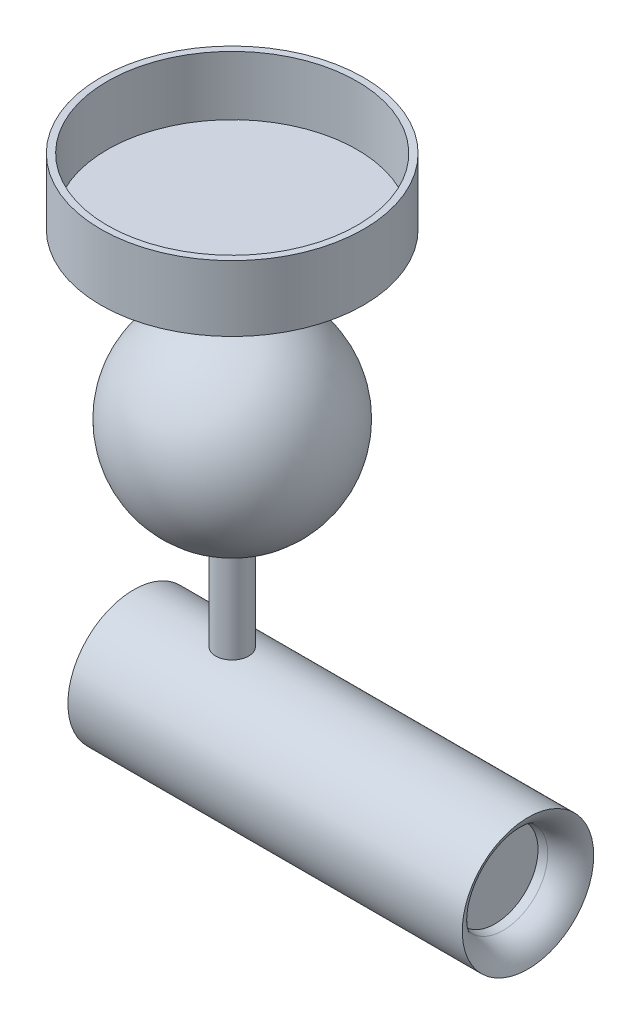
ISO-10303-21;
HEADER;
FILE_DESCRIPTION(('STEP AP214'),'2;1');
FILE_NAME('part.step','',(''),(''),'','','');
FILE_SCHEMA(('AUTOMOTIVE_DESIGN { 1 0 10303 214 1 1 1 1 }'));
ENDSEC;
DATA;
#1=APPLICATION_CONTEXT('core data for automotive mechanical design processes');
#2=APPLICATION_PROTOCOL_DEFINITION('international standard','automotive_design',2000,#1);
#3=PRODUCT_CONTEXT('',#1,'mechanical');
#4=PRODUCT('Part','Part','',(#3));
#5=PRODUCT_RELATED_PRODUCT_CATEGORY('part','',(#4));
#6=PRODUCT_DEFINITION_FORMATION('','',#4);
#7=PRODUCT_DEFINITION_CONTEXT('part definition',#1,'design');
#8=PRODUCT_DEFINITION('design','',#6,#7);
#9=PRODUCT_DEFINITION_SHAPE('','',#8);
#10=(LENGTH_UNIT() NAMED_UNIT(*) SI_UNIT(.MILLI.,.METRE.));
#11=(NAMED_UNIT(*) PLANE_ANGLE_UNIT() SI_UNIT($,.RADIAN.));
#12=(NAMED_UNIT(*) SI_UNIT($,.STERADIAN.) SOLID_ANGLE_UNIT());
#13=UNCERTAINTY_MEASURE_WITH_UNIT(LENGTH_MEASURE(1.E-05),#10,'distance_accuracy_value','');
#14=(GEOMETRIC_REPRESENTATION_CONTEXT(3) GLOBAL_UNCERTAINTY_ASSIGNED_CONTEXT((#13)) GLOBAL_UNIT_ASSIGNED_CONTEXT((#10,
#11,#12)) REPRESENTATION_CONTEXT('',''));
#15=CARTESIAN_POINT('',(0.,0.,0.));
#16=DIRECTION('',(0.,0.,1.));
#17=DIRECTION('',(1.,0.,0.));
#18=AXIS2_PLACEMENT_3D('',#15,#16,#17);
#19=CARTESIAN_POINT('',(-30.,-130.,0.));
#20=DIRECTION('',(1.,0.,0.));
#21=DIRECTION('',(0.,0.,-1.));
#22=AXIS2_PLACEMENT_3D('',#19,#20,#21);
#23=CYLINDRICAL_SURFACE('',#22,20.);
#24=CARTESIAN_POINT('',(-30.,-130.,0.));
#25=DIRECTION('',(1.,0.,0.));
#26=DIRECTION('',(0.,0.,-1.));
#27=AXIS2_PLACEMENT_3D('',#24,#25,#26);
#28=CIRCLE('',#27,20.);
#29=CARTESIAN_POINT('',(-30.,-130.,-20.));
#30=VERTEX_POINT('',#29);
#31=EDGE_CURVE('E64',#30,#30,#28,.T.);
#32=ORIENTED_EDGE('',*,*,#31,.T.);
#33=EDGE_LOOP('',(#32));
#34=FACE_BOUND('',#33,.T.);
#35=CARTESIAN_POINT('',(90.,-130.,0.));
#36=DIRECTION('',(1.,0.,0.));
#37=DIRECTION('',(0.,0.,-1.));
#38=AXIS2_PLACEMENT_3D('',#35,#36,#37);
#39=CIRCLE('',#38,20.);
#40=CARTESIAN_POINT('',(90.,-130.,-20.));
#41=VERTEX_POINT('',#40);
#42=EDGE_CURVE('E69',#41,#41,#39,.T.);
#43=ORIENTED_EDGE('',*,*,#42,.F.);
#44=EDGE_LOOP('',(#43));
#45=FACE_BOUND('',#44,.T.);
#46=ADVANCED_FACE('F56',(#34,#45),#23,.T.);
#47=CARTESIAN_POINT('',(-30.,-130.,0.));
#48=DIRECTION('',(1.,0.,0.));
#49=DIRECTION('',(0.,0.,-1.));
#50=AXIS2_PLACEMENT_3D('',#47,#48,#49);
#51=PLANE('',#50);
#52=ORIENTED_EDGE('',*,*,#31,.F.);
#53=EDGE_LOOP('',(#52));
#54=FACE_BOUND('',#53,.T.);
#55=ADVANCED_FACE('F85',(#54),#51,.F.);
#56=CARTESIAN_POINT('',(90.,-130.,0.));
#57=DIRECTION('',(1.,0.,0.));
#58=DIRECTION('',(0.,0.,-1.));
#59=AXIS2_PLACEMENT_3D('',#56,#57,#58);
#60=CONICAL_SURFACE('',#59,15.,0.191986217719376);
#61=CARTESIAN_POINT('',(82.4880806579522,-130.,0.));
#62=DIRECTION('',(-1.,0.,0.));
#63=DIRECTION('',(0.,0.,1.));
#64=AXIS2_PLACEMENT_3D('',#61,#62,#63);
#65=CIRCLE('',#64,13.5398307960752);
#66=CARTESIAN_POINT('',(82.4880806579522,-130.,13.5398307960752));
#67=VERTEX_POINT('',#66);
#68=EDGE_CURVE('E12',#67,#67,#65,.F.);
#69=ORIENTED_EDGE('',*,*,#68,.T.);
#70=EDGE_LOOP('',(#69));
#71=FACE_BOUND('',#70,.T.);
#72=CARTESIAN_POINT('',(80.,-130.,0.));
#73=DIRECTION('',(1.,0.,0.));
#74=DIRECTION('',(0.,0.,-1.));
#75=AXIS2_PLACEMENT_3D('',#72,#73,#74);
#76=CIRCLE('',#75,13.0561969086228);
#77=CARTESIAN_POINT('',(80.,-130.,-13.0561969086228));
#78=VERTEX_POINT('',#77);
#79=EDGE_CURVE('E74',#78,#78,#76,.T.);
#80=ORIENTED_EDGE('',*,*,#79,.F.);
#81=EDGE_LOOP('',(#80));
#82=FACE_BOUND('',#81,.T.);
#83=ADVANCED_FACE('F83',(#71,#82),#60,.F.);
#84=CARTESIAN_POINT('',(80.,-130.,0.));
#85=DIRECTION('',(1.,0.,0.));
#86=DIRECTION('',(0.,0.,-1.));
#87=AXIS2_PLACEMENT_3D('',#84,#85,#86);
#88=PLANE('',#87);
#89=ORIENTED_EDGE('',*,*,#79,.T.);
#90=EDGE_LOOP('',(#89));
#91=FACE_BOUND('',#90,.T.);
#92=ADVANCED_FACE('F81',(#91),#88,.T.);
#93=CARTESIAN_POINT('',(80.5799907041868,-130.,0.));
#94=DIRECTION('',(1.,0.,0.));
#95=DIRECTION('',(0.,0.,-1.));
#96=AXIS2_PLACEMENT_3D('',#93,#94,#95);
#97=TOROIDAL_SURFACE('',#96,23.3561026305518,10.);
#98=ORIENTED_EDGE('',*,*,#42,.T.);
#99=EDGE_LOOP('',(#98));
#100=FACE_BOUND('',#99,.T.);
#101=ORIENTED_EDGE('',*,*,#68,.F.);
#102=EDGE_LOOP('',(#101));
#103=FACE_BOUND('',#102,.T.);
#104=ADVANCED_FACE('F58',(#100,#103),#97,.T.);
#105=CLOSED_SHELL('',(#46,#55,#83,#92,#104));
#106=MANIFOLD_SOLID_BREP('B2',#105);
#107=CARTESIAN_POINT('',(0.,-80.,0.));
#108=DIRECTION('',(0.,-1.,0.));
#109=DIRECTION('',(1.,0.,0.));
#110=AXIS2_PLACEMENT_3D('',#107,#108,#109);
#111=PLANE('',#110);
#112=CARTESIAN_POINT('',(0.,-80.,0.));
#113=DIRECTION('',(0.,-1.,0.));
#114=DIRECTION('',(1.,0.,0.));
#115=AXIS2_PLACEMENT_3D('',#112,#113,#114);
#116=CIRCLE('',#115,5.);
#117=CARTESIAN_POINT('',(5.,-80.,0.));
#118=VERTEX_POINT('',#117);
#119=EDGE_CURVE('E153',#118,#118,#116,.T.);
#120=ORIENTED_EDGE('',*,*,#119,.F.);
#121=EDGE_LOOP('',(#120));
#122=FACE_BOUND('',#121,.T.);
#123=ADVANCED_FACE('F147',(#122),#111,.F.);
#124=CARTESIAN_POINT('',(0.,-110.,0.));
#125=DIRECTION('',(0.,-1.,0.));
#126=DIRECTION('',(1.,0.,0.));
#127=AXIS2_PLACEMENT_3D('',#124,#125,#126);
#128=PLANE('',#127);
#129=CARTESIAN_POINT('',(0.,-110.,0.));
#130=DIRECTION('',(0.,-1.,0.));
#131=DIRECTION('',(1.,0.,0.));
#132=AXIS2_PLACEMENT_3D('',#129,#130,#131);
#133=CIRCLE('',#132,5.);
#134=CARTESIAN_POINT('',(5.,-110.,0.));
#135=VERTEX_POINT('',#134);
#136=EDGE_CURVE('E55',#135,#135,#133,.T.);
#137=ORIENTED_EDGE('',*,*,#136,.T.);
#138=EDGE_LOOP('',(#137));
#139=FACE_BOUND('',#138,.T.);
#140=ADVANCED_FACE('F162',(#139),#128,.T.);
#141=CARTESIAN_POINT('',(0.,-80.,0.));
#142=DIRECTION('',(0.,-1.,0.));
#143=DIRECTION('',(1.,0.,0.));
#144=AXIS2_PLACEMENT_3D('',#141,#142,#143);
#145=CYLINDRICAL_SURFACE('',#144,5.);
#146=ORIENTED_EDGE('',*,*,#136,.F.);
#147=EDGE_LOOP('',(#146));
#148=FACE_BOUND('',#147,.T.);
#149=ORIENTED_EDGE('',*,*,#119,.T.);
#150=EDGE_LOOP('',(#149));
#151=FACE_BOUND('',#150,.T.);
#152=ADVANCED_FACE('F159',(#148,#151),#145,.T.);
#153=CLOSED_SHELL('',(#123,#140,#152));
#154=MANIFOLD_SOLID_BREP('B7',#153);
#155=CARTESIAN_POINT('',(0.,-50.,0.));
#156=DIRECTION('',(0.,1.,0.));
#157=DIRECTION('',(1.,0.,0.));
#158=AXIS2_PLACEMENT_3D('',#155,#156,#157);
#159=SPHERICAL_SURFACE('',#158,30.);
#160=CARTESIAN_POINT('',(0.,-20.,0.));
#161=VERTEX_POINT('',#160);
#162=VERTEX_LOOP('',#161);
#163=FACE_BOUND('',#162,.T.);
#164=ADVANCED_FACE('F201',(#163),#159,.T.);
#165=CLOSED_SHELL('',(#164));
#166=MANIFOLD_SOLID_BREP('B50',#165);
#167=CARTESIAN_POINT('',(0.,20.,0.));
#168=DIRECTION('',(0.,-1.,0.));
#169=DIRECTION('',(0.,0.,-1.));
#170=AXIS2_PLACEMENT_3D('',#167,#168,#169);
#171=CYLINDRICAL_SURFACE('',#170,40.);
#172=CARTESIAN_POINT('',(0.,20.,0.));
#173=DIRECTION('',(0.,1.,0.));
#174=DIRECTION('',(0.,0.,1.));
#175=AXIS2_PLACEMENT_3D('',#172,#173,#174);
#176=CIRCLE('',#175,40.);
#177=CARTESIAN_POINT('',(0.,20.,40.));
#178=VERTEX_POINT('',#177);
#179=EDGE_CURVE('E222',#178,#178,#176,.T.);
#180=ORIENTED_EDGE('',*,*,#179,.F.);
#181=EDGE_LOOP('',(#180));
#182=FACE_BOUND('',#181,.T.);
#183=CARTESIAN_POINT('',(0.,0.,0.));
#184=DIRECTION('',(0.,1.,0.));
#185=DIRECTION('',(0.,0.,1.));
#186=AXIS2_PLACEMENT_3D('',#183,#184,#185);
#187=CIRCLE('',#186,40.);
#188=CARTESIAN_POINT('',(0.,0.,40.));
#189=VERTEX_POINT('',#188);
#190=EDGE_CURVE('E226',#189,#189,#187,.T.);
#191=ORIENTED_EDGE('',*,*,#190,.T.);
#192=EDGE_LOOP('',(#191));
#193=FACE_BOUND('',#192,.T.);
#194=ADVANCED_FACE('F216',(#182,#193),#171,.T.);
#195=CARTESIAN_POINT('',(0.,20.,0.));
#196=DIRECTION('',(0.,1.,0.));
#197=DIRECTION('',(0.,0.,1.));
#198=AXIS2_PLACEMENT_3D('',#195,#196,#197);
#199=PLANE('',#198);
#200=CARTESIAN_POINT('',(0.,20.,0.));
#201=DIRECTION('',(0.,1.,0.));
#202=DIRECTION('',(0.,0.,1.));
#203=AXIS2_PLACEMENT_3D('',#200,#201,#202);
#204=CIRCLE('',#203,38.);
#205=CARTESIAN_POINT('',(0.,20.,38.));
#206=VERTEX_POINT('',#205);
#207=EDGE_CURVE('E236',#206,#206,#204,.T.);
#208=ORIENTED_EDGE('',*,*,#207,.F.);
#209=EDGE_LOOP('',(#208));
#210=FACE_BOUND('',#209,.T.);
#211=ORIENTED_EDGE('',*,*,#179,.T.);
#212=EDGE_LOOP('',(#211));
#213=FACE_BOUND('',#212,.T.);
#214=ADVANCED_FACE('F251',(#210,#213),#199,.T.);
#215=CARTESIAN_POINT('',(0.,0.,0.));
#216=DIRECTION('',(0.,1.,0.));
#217=DIRECTION('',(0.,0.,1.));
#218=AXIS2_PLACEMENT_3D('',#215,#216,#217);
#219=PLANE('',#218);
#220=CARTESIAN_POINT('',(0.,0.,0.));
#221=DIRECTION('',(0.,1.,0.));
#222=DIRECTION('',(0.,0.,1.));
#223=AXIS2_PLACEMENT_3D('',#220,#221,#222);
#224=CIRCLE('',#223,5.);
#225=CARTESIAN_POINT('',(0.,0.,5.));
#226=VERTEX_POINT('',#225);
#227=EDGE_CURVE('E200',#226,#226,#224,.F.);
#228=ORIENTED_EDGE('',*,*,#227,.F.);
#229=EDGE_LOOP('',(#228));
#230=FACE_BOUND('',#229,.T.);
#231=ORIENTED_EDGE('',*,*,#190,.F.);
#232=EDGE_LOOP('',(#231));
#233=FACE_BOUND('',#232,.T.);
#234=ADVANCED_FACE('F253',(#230,#233),#219,.F.);
#235=CARTESIAN_POINT('',(0.,-20.,0.));
#236=DIRECTION('',(0.,1.,0.));
#237=DIRECTION('',(0.,0.,1.));
#238=AXIS2_PLACEMENT_3D('',#235,#236,#237);
#239=CYLINDRICAL_SURFACE('',#238,5.);
#240=CARTESIAN_POINT('',(0.,-20.,0.));
#241=DIRECTION('',(0.,-1.,0.));
#242=DIRECTION('',(0.,0.,-1.));
#243=AXIS2_PLACEMENT_3D('',#240,#241,#242);
#244=CIRCLE('',#243,5.);
#245=CARTESIAN_POINT('',(0.,-20.,-5.));
#246=VERTEX_POINT('',#245);
#247=EDGE_CURVE('E231',#246,#246,#244,.T.);
#248=ORIENTED_EDGE('',*,*,#247,.F.);
#249=EDGE_LOOP('',(#248));
#250=FACE_BOUND('',#249,.T.);
#251=ORIENTED_EDGE('',*,*,#227,.T.);
#252=EDGE_LOOP('',(#251));
#253=FACE_BOUND('',#252,.T.);
#254=ADVANCED_FACE('F259',(#250,#253),#239,.T.);
#255=CARTESIAN_POINT('',(0.,-20.,0.));
#256=DIRECTION('',(0.,-1.,0.));
#257=DIRECTION('',(0.,0.,-1.));
#258=AXIS2_PLACEMENT_3D('',#255,#256,#257);
#259=PLANE('',#258);
#260=ORIENTED_EDGE('',*,*,#247,.T.);
#261=EDGE_LOOP('',(#260));
#262=FACE_BOUND('',#261,.T.);
#263=ADVANCED_FACE('F247',(#262),#259,.T.);
#264=CARTESIAN_POINT('',(0.,2.,0.));
#265=DIRECTION('',(0.,1.,0.));
#266=DIRECTION('',(0.,0.,1.));
#267=AXIS2_PLACEMENT_3D('',#264,#265,#266);
#268=CYLINDRICAL_SURFACE('',#267,38.);
#269=CARTESIAN_POINT('',(0.,2.,0.));
#270=DIRECTION('',(0.,1.,0.));
#271=DIRECTION('',(0.,0.,1.));
#272=AXIS2_PLACEMENT_3D('',#269,#270,#271);
#273=CIRCLE('',#272,38.);
#274=CARTESIAN_POINT('',(0.,2.,38.));
#275=VERTEX_POINT('',#274);
#276=EDGE_CURVE('E235',#275,#275,#273,.T.);
#277=ORIENTED_EDGE('',*,*,#276,.F.);
#278=EDGE_LOOP('',(#277));
#279=FACE_BOUND('',#278,.T.);
#280=ORIENTED_EDGE('',*,*,#207,.T.);
#281=EDGE_LOOP('',(#280));
#282=FACE_BOUND('',#281,.T.);
#283=ADVANCED_FACE('F244',(#279,#282),#268,.F.);
#284=CARTESIAN_POINT('',(0.,2.,0.));
#285=DIRECTION('',(0.,1.,0.));
#286=DIRECTION('',(0.,0.,1.));
#287=AXIS2_PLACEMENT_3D('',#284,#285,#286);
#288=PLANE('',#287);
#289=ORIENTED_EDGE('',*,*,#276,.T.);
#290=EDGE_LOOP('',(#289));
#291=FACE_BOUND('',#290,.T.);
#292=ADVANCED_FACE('F242',(#291),#288,.T.);
#293=CLOSED_SHELL('',(#194,#214,#234,#254,#263,#283,#292));
#294=MANIFOLD_SOLID_BREP('B143',#293);
#295=ADVANCED_BREP_SHAPE_REPRESENTATION('',(#18,#106,#154,#166,#294),#14);
#296=SHAPE_DEFINITION_REPRESENTATION(#9,#295);
ENDSEC;
END-ISO-10303-21;
